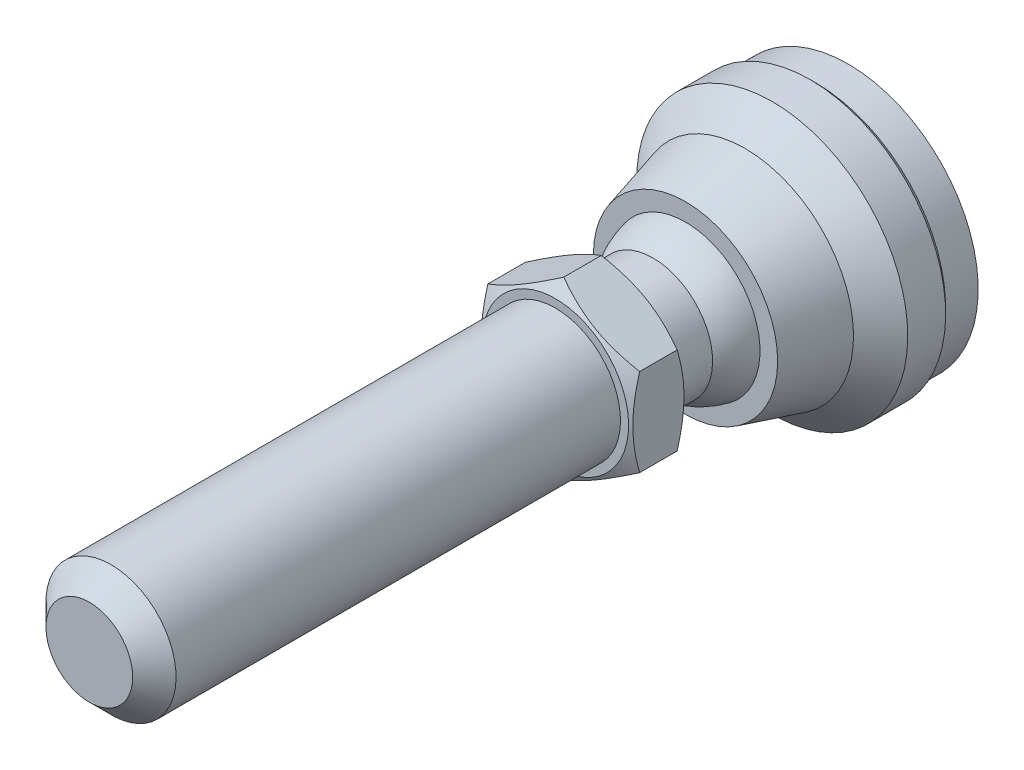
ISO-10303-21;
HEADER;
FILE_DESCRIPTION(('STEP AP214'),'2;1');
FILE_NAME('part.step','',(''),(''),'','','');
FILE_SCHEMA(('AUTOMOTIVE_DESIGN { 1 0 10303 214 1 1 1 1 }'));
ENDSEC;
DATA;
#1=APPLICATION_CONTEXT('core data for automotive mechanical design processes');
#2=APPLICATION_PROTOCOL_DEFINITION('international standard','automotive_design',2000,#1);
#3=PRODUCT_CONTEXT('',#1,'mechanical');
#4=PRODUCT('Part','Part','',(#3));
#5=PRODUCT_RELATED_PRODUCT_CATEGORY('part','',(#4));
#6=PRODUCT_DEFINITION_FORMATION('','',#4);
#7=PRODUCT_DEFINITION_CONTEXT('part definition',#1,'design');
#8=PRODUCT_DEFINITION('design','',#6,#7);
#9=PRODUCT_DEFINITION_SHAPE('','',#8);
#10=(LENGTH_UNIT() NAMED_UNIT(*) SI_UNIT(.MILLI.,.METRE.));
#11=(NAMED_UNIT(*) PLANE_ANGLE_UNIT() SI_UNIT($,.RADIAN.));
#12=(NAMED_UNIT(*) SI_UNIT($,.STERADIAN.) SOLID_ANGLE_UNIT());
#13=UNCERTAINTY_MEASURE_WITH_UNIT(LENGTH_MEASURE(1.E-05),#10,'distance_accuracy_value','');
#14=(GEOMETRIC_REPRESENTATION_CONTEXT(3) GLOBAL_UNCERTAINTY_ASSIGNED_CONTEXT((#13)) GLOBAL_UNIT_ASSIGNED_CONTEXT((#10,
#11,#12)) REPRESENTATION_CONTEXT('',''));
#15=CARTESIAN_POINT('',(0.,0.,0.));
#16=DIRECTION('',(0.,0.,1.));
#17=DIRECTION('',(1.,0.,0.));
#18=AXIS2_PLACEMENT_3D('',#15,#16,#17);
#19=CARTESIAN_POINT('',(-5.49999999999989,0.,21.9999999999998));
#20=DIRECTION('',(0.,0.,1.));
#21=DIRECTION('',(0.,-1.,0.));
#22=AXIS2_PLACEMENT_3D('',#19,#20,#21);
#23=PLANE('',#22);
#24=CARTESIAN_POINT('',(0.,0.,21.9999999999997));
#25=DIRECTION('',(0.,0.,1.));
#26=DIRECTION('',(0.,-1.,0.));
#27=AXIS2_PLACEMENT_3D('',#24,#25,#26);
#28=CIRCLE('',#27,6.75);
#29=CARTESIAN_POINT('',(0.,-6.75,21.9999999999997));
#30=VERTEX_POINT('',#29);
#31=EDGE_CURVE('E440',#30,#30,#28,.T.);
#32=ORIENTED_EDGE('',*,*,#31,.F.);
#33=EDGE_LOOP('',(#32));
#34=FACE_BOUND('',#33,.T.);
#35=CARTESIAN_POINT('',(0.,0.,21.9999999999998));
#36=DIRECTION('',(0.,0.,-1.));
#37=DIRECTION('',(0.,1.,0.));
#38=AXIS2_PLACEMENT_3D('',#35,#36,#37);
#39=CIRCLE('',#38,5.49999999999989);
#40=CARTESIAN_POINT('',(0.,5.49999999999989,21.9999999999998));
#41=VERTEX_POINT('',#40);
#42=EDGE_CURVE('E120',#41,#41,#39,.T.);
#43=ORIENTED_EDGE('',*,*,#42,.F.);
#44=EDGE_LOOP('',(#43));
#45=FACE_BOUND('',#44,.T.);
#46=ADVANCED_FACE('F14',(#34,#45),#23,.F.);
#47=CARTESIAN_POINT('',(0.,0.,0.));
#48=DIRECTION('',(0.,0.,-1.));
#49=DIRECTION('',(0.,1.,0.));
#50=AXIS2_PLACEMENT_3D('',#47,#48,#49);
#51=CYLINDRICAL_SURFACE('',#50,5.49999999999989);
#52=CARTESIAN_POINT('',(0.,0.,18.));
#53=DIRECTION('',(0.,0.,-1.));
#54=DIRECTION('',(0.,1.,0.));
#55=AXIS2_PLACEMENT_3D('',#52,#53,#54);
#56=CIRCLE('',#55,5.49999999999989);
#57=CARTESIAN_POINT('',(-5.49999999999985,0.,18.));
#58=VERTEX_POINT('',#57);
#59=EDGE_CURVE('E117',#58,#58,#56,.T.);
#60=ORIENTED_EDGE('',*,*,#59,.F.);
#61=EDGE_LOOP('',(#60));
#62=FACE_BOUND('',#61,.T.);
#63=ORIENTED_EDGE('',*,*,#42,.T.);
#64=EDGE_LOOP('',(#63));
#65=FACE_BOUND('',#64,.T.);
#66=ADVANCED_FACE('F144',(#62,#65),#51,.T.);
#67=CARTESIAN_POINT('',(0.,0.,13.6698729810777));
#68=DIRECTION('',(0.,0.,-1.));
#69=DIRECTION('',(-1.,0.,0.));
#70=AXIS2_PLACEMENT_3D('',#67,#68,#69);
#71=SPHERICAL_SURFACE('',#70,7.);
#72=CARTESIAN_POINT('',(0.,0.,15.));
#73=DIRECTION('',(0.,0.,-1.));
#74=DIRECTION('',(0.,1.,0.));
#75=AXIS2_PLACEMENT_3D('',#72,#73,#74);
#76=CIRCLE('',#75,6.87246404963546);
#77=CARTESIAN_POINT('',(-6.87246404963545,0.,15.));
#78=VERTEX_POINT('',#77);
#79=EDGE_CURVE('E114',#78,#78,#76,.T.);
#80=CARTESIAN_POINT('',(-6.87246404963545,0.,15.));
#81=CARTESIAN_POINT('',(-6.86587210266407,0.,15.0340591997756));
#82=CARTESIAN_POINT('',(-6.85902692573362,0.,15.0680693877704));
#83=CARTESIAN_POINT('',(-6.84483171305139,0.,15.1359842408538));
#84=CARTESIAN_POINT('',(-6.83748167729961,0.,15.1698889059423));
#85=CARTESIAN_POINT('',(-6.82227834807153,0.,15.2375852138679));
#86=CARTESIAN_POINT('',(-6.81442505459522,0.,15.2713768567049));
#87=CARTESIAN_POINT('',(-6.79821695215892,0.,15.3388396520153));
#88=CARTESIAN_POINT('',(-6.78986214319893,0.,15.3725108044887));
#89=CARTESIAN_POINT('',(-6.77265285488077,0.,15.4397251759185));
#90=CARTESIAN_POINT('',(-6.7637983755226,0.,15.473268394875));
#91=CARTESIAN_POINT('',(-6.74559170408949,0.,15.5402194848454));
#92=CARTESIAN_POINT('',(-6.73623951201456,0.,15.5736273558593));
#93=CARTESIAN_POINT('',(-6.71703948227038,0.,15.6403003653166));
#94=CARTESIAN_POINT('',(-6.70719164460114,0.,15.67356550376));
#95=CARTESIAN_POINT('',(-6.68700250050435,0.,15.7399456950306));
#96=CARTESIAN_POINT('',(-6.67666119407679,0.,15.7730607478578));
#97=CARTESIAN_POINT('',(-6.65548739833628,0.,15.8391334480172));
#98=CARTESIAN_POINT('',(-6.64465490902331,0.,15.8720910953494));
#99=CARTESIAN_POINT('',(-6.62250114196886,0.,15.9378416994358));
#100=CARTESIAN_POINT('',(-6.61117986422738,0.,15.9706346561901));
#101=CARTESIAN_POINT('',(-6.58805102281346,0.,16.0360486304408));
#102=CARTESIAN_POINT('',(-6.57624345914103,0.,16.0686696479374));
#103=CARTESIAN_POINT('',(-6.55214465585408,0.,16.1337325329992));
#104=CARTESIAN_POINT('',(-6.53985341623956,0.,16.1661744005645));
#105=CARTESIAN_POINT('',(-6.51478997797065,0.,16.2308718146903));
#106=CARTESIAN_POINT('',(-6.50201777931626,0.,16.2631273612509));
#107=CARTESIAN_POINT('',(-6.47599524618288,0.,16.3274450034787));
#108=CARTESIAN_POINT('',(-6.4627449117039,0.,16.3595070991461));
#109=CARTESIAN_POINT('',(-6.43576903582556,0.,16.4234307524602));
#110=CARTESIAN_POINT('',(-6.4220434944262,0.,16.455292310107));
#111=CARTESIAN_POINT('',(-6.39412023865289,0.,16.5188078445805));
#112=CARTESIAN_POINT('',(-6.37992252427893,0.,16.5504618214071));
#113=CARTESIAN_POINT('',(-6.35105806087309,0.,16.6135551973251));
#114=CARTESIAN_POINT('',(-6.33639131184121,0.,16.6449945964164));
#115=CARTESIAN_POINT('',(-6.30659202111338,0.,16.7076518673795));
#116=CARTESIAN_POINT('',(-6.29145947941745,0.,16.7388697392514));
#117=CARTESIAN_POINT('',(-6.26073194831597,0.,16.8010770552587));
#118=CARTESIAN_POINT('',(-6.24513695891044,0.,16.8320664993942));
#119=CARTESIAN_POINT('',(-6.21348797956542,0.,16.8938101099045));
#120=CARTESIAN_POINT('',(-6.19743398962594,0.,16.9245642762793));
#121=CARTESIAN_POINT('',(-6.16487055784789,0.,16.9858305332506));
#122=CARTESIAN_POINT('',(-6.14836111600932,0.,17.016342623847));
#123=CARTESIAN_POINT('',(-6.11489042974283,0.,17.0771179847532));
#124=CARTESIAN_POINT('',(-6.0979291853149,0.,17.107381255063));
#125=CARTESIAN_POINT('',(-6.06355864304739,0.,17.1676522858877));
#126=CARTESIAN_POINT('',(-6.04614934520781,0.,17.1976600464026));
#127=CARTESIAN_POINT('',(-6.01088654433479,0.,17.2574134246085));
#128=CARTESIAN_POINT('',(-5.99303304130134,0.,17.2871590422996));
#129=CARTESIAN_POINT('',(-5.95688577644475,0.,17.3463815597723));
#130=CARTESIAN_POINT('',(-5.93859201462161,0.,17.3758584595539));
#131=CARTESIAN_POINT('',(-5.90156827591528,0.,17.4345370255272));
#132=CARTESIAN_POINT('',(-5.88283829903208,0.,17.4637386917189));
#133=CARTESIAN_POINT('',(-5.84494627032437,0.,17.5218603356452));
#134=CARTESIAN_POINT('',(-5.82578421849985,0.,17.5507803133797));
#135=CARTESIAN_POINT('',(-5.78703227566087,0.,17.6083321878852));
#136=CARTESIAN_POINT('',(-5.76744238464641,0.,17.6369640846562));
#137=CARTESIAN_POINT('',(-5.72783909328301,0.,17.6939334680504));
#138=CARTESIAN_POINT('',(-5.70782569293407,0.,17.7222709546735));
#139=CARTESIAN_POINT('',(-5.66737980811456,0.,17.778645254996));
#140=CARTESIAN_POINT('',(-5.646947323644,0.,17.8066820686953));
#141=CARTESIAN_POINT('',(-5.60566778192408,0.,17.862448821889));
#142=CARTESIAN_POINT('',(-5.58482072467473,0.,17.8901787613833));
#143=CARTESIAN_POINT('',(-5.54271666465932,0.,17.9453256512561));
#144=CARTESIAN_POINT('',(-5.52145966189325,0.,17.9727426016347));
#145=CARTESIAN_POINT('',(-5.49999999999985,0.,18.));
#146=B_SPLINE_CURVE_WITH_KNOTS('',3,(#80,#81,#82,#83,#84,#85,#86,#87,#88,#89,#90,#91,#92,#93,
#94,#95,#96,#97,#98,#99,#100,#101,#102,#103,#104,#105,#106,#107,#108,#109,#110,#111,#112,#113,
#114,#115,#116,#117,#118,#119,#120,#121,#122,#123,#124,#125,#126,#127,#128,#129,#130,#131,#132,
#133,#134,#135,#136,#137,#138,#139,#140,#141,#142,#143,#144,#145),.UNSPECIFIED.,.F.,.F.,(4,2,2,
2,2,2,2,2,2,2,2,2,2,2,2,2,2,2,2,2,2,2,2,2,2,2,2,2,2,2,2,2,4),(0.,0.104072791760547,
0.208145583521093,0.312218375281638,0.416291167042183,0.520363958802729,0.624436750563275,
0.728509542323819,0.832582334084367,0.936655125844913,1.04072791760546,1.144800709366,
1.24887350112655,1.3529462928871,1.45701908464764,1.56109187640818,1.66516466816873,
1.76923745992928,1.87331025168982,1.97738304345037,2.08145583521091,2.18552862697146,
2.28960141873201,2.39367421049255,2.4977470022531,2.60181979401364,2.70589258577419,
2.80996537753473,2.91403816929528,3.01811096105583,3.12218375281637,3.22625654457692,
3.33032933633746),.UNSPECIFIED.);
#147=EDGE_CURVE('BSEAM151',#78,#58,#146,.T.);
#148=ORIENTED_EDGE('',*,*,#79,.F.);
#149=ORIENTED_EDGE('',*,*,#59,.T.);
#150=ORIENTED_EDGE('',*,*,#147,.T.);
#151=ORIENTED_EDGE('',*,*,#147,.F.);
#152=EDGE_LOOP('',(#148,#150,#149,#151));
#153=FACE_BOUND('',#152,.T.);
#154=ADVANCED_FACE('F151',(#153),#71,.T.);
#155=CARTESIAN_POINT('',(-8.5,0.,15.));
#156=DIRECTION('',(0.,0.,-1.));
#157=DIRECTION('',(0.,1.,0.));
#158=AXIS2_PLACEMENT_3D('',#155,#156,#157);
#159=PLANE('',#158);
#160=CARTESIAN_POINT('',(0.,0.,15.));
#161=DIRECTION('',(0.,0.,-1.));
#162=DIRECTION('',(0.,1.,0.));
#163=AXIS2_PLACEMENT_3D('',#160,#161,#162);
#164=CIRCLE('',#163,8.5);
#165=CARTESIAN_POINT('',(0.,8.5,15.));
#166=VERTEX_POINT('',#165);
#167=EDGE_CURVE('E111',#166,#166,#164,.T.);
#168=ORIENTED_EDGE('',*,*,#167,.F.);
#169=EDGE_LOOP('',(#168));
#170=FACE_BOUND('',#169,.T.);
#171=ORIENTED_EDGE('',*,*,#79,.T.);
#172=EDGE_LOOP('',(#171));
#173=FACE_BOUND('',#172,.T.);
#174=ADVANCED_FACE('F303',(#170,#173),#159,.F.);
#175=CARTESIAN_POINT('',(0.,0.,15.));
#176=DIRECTION('',(0.,0.,-1.));
#177=DIRECTION('',(0.,1.,0.));
#178=AXIS2_PLACEMENT_3D('',#175,#176,#177);
#179=CONICAL_SURFACE('',#178,8.5,0.266252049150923);
#180=CARTESIAN_POINT('',(0.,0.,9.4999999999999));
#181=DIRECTION('',(0.,0.,-1.));
#182=DIRECTION('',(0.,1.,0.));
#183=AXIS2_PLACEMENT_3D('',#180,#181,#182);
#184=CIRCLE('',#183,10.);
#185=CARTESIAN_POINT('',(0.,10.,9.4999999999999));
#186=VERTEX_POINT('',#185);
#187=EDGE_CURVE('E108',#186,#186,#184,.T.);
#188=ORIENTED_EDGE('',*,*,#187,.F.);
#189=EDGE_LOOP('',(#188));
#190=FACE_BOUND('',#189,.T.);
#191=ORIENTED_EDGE('',*,*,#167,.T.);
#192=EDGE_LOOP('',(#191));
#193=FACE_BOUND('',#192,.T.);
#194=ADVANCED_FACE('F293',(#190,#193),#179,.T.);
#195=CARTESIAN_POINT('',(0.,0.,9.4999999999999));
#196=DIRECTION('',(0.,0.,-1.));
#197=DIRECTION('',(0.,1.,0.));
#198=AXIS2_PLACEMENT_3D('',#195,#196,#197);
#199=CONICAL_SURFACE('',#198,10.,0.785398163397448);
#200=CARTESIAN_POINT('',(0.,0.,6.99999999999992));
#201=DIRECTION('',(0.,0.,-1.));
#202=DIRECTION('',(0.,1.,0.));
#203=AXIS2_PLACEMENT_3D('',#200,#201,#202);
#204=CIRCLE('',#203,12.5);
#205=CARTESIAN_POINT('',(0.,12.5,6.99999999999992));
#206=VERTEX_POINT('',#205);
#207=EDGE_CURVE('E105',#206,#206,#204,.T.);
#208=ORIENTED_EDGE('',*,*,#207,.F.);
#209=EDGE_LOOP('',(#208));
#210=FACE_BOUND('',#209,.T.);
#211=ORIENTED_EDGE('',*,*,#187,.T.);
#212=EDGE_LOOP('',(#211));
#213=FACE_BOUND('',#212,.T.);
#214=ADVANCED_FACE('F283',(#210,#213),#199,.T.);
#215=CARTESIAN_POINT('',(0.,0.,0.));
#216=DIRECTION('',(0.,0.,-1.));
#217=DIRECTION('',(0.,1.,0.));
#218=AXIS2_PLACEMENT_3D('',#215,#216,#217);
#219=CYLINDRICAL_SURFACE('',#218,12.5);
#220=CARTESIAN_POINT('',(0.,0.,3.49999999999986));
#221=DIRECTION('',(0.,0.,-1.));
#222=DIRECTION('',(0.,1.,0.));
#223=AXIS2_PLACEMENT_3D('',#220,#221,#222);
#224=CIRCLE('',#223,12.5);
#225=CARTESIAN_POINT('',(0.,12.5,3.49999999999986));
#226=VERTEX_POINT('',#225);
#227=EDGE_CURVE('E102',#226,#226,#224,.T.);
#228=ORIENTED_EDGE('',*,*,#227,.F.);
#229=EDGE_LOOP('',(#228));
#230=FACE_BOUND('',#229,.T.);
#231=ORIENTED_EDGE('',*,*,#207,.T.);
#232=EDGE_LOOP('',(#231));
#233=FACE_BOUND('',#232,.T.);
#234=ADVANCED_FACE('F273',(#230,#233),#219,.T.);
#235=CARTESIAN_POINT('',(0.,0.,3.49999999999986));
#236=DIRECTION('',(0.,0.,1.));
#237=DIRECTION('',(0.,-1.,0.));
#238=AXIS2_PLACEMENT_3D('',#235,#236,#237);
#239=CONICAL_SURFACE('',#238,12.5,0.785398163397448);
#240=CARTESIAN_POINT('',(0.,0.,2.99999999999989));
#241=DIRECTION('',(0.,0.,-1.));
#242=DIRECTION('',(0.,1.,0.));
#243=AXIS2_PLACEMENT_3D('',#240,#241,#242);
#244=CIRCLE('',#243,12.);
#245=CARTESIAN_POINT('',(0.,12.,2.99999999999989));
#246=VERTEX_POINT('',#245);
#247=EDGE_CURVE('E99',#246,#246,#244,.T.);
#248=ORIENTED_EDGE('',*,*,#247,.F.);
#249=EDGE_LOOP('',(#248));
#250=FACE_BOUND('',#249,.T.);
#251=ORIENTED_EDGE('',*,*,#227,.T.);
#252=EDGE_LOOP('',(#251));
#253=FACE_BOUND('',#252,.T.);
#254=ADVANCED_FACE('F263',(#250,#253),#239,.T.);
#255=CARTESIAN_POINT('',(0.,0.,0.));
#256=DIRECTION('',(0.,0.,-1.));
#257=DIRECTION('',(0.,1.,0.));
#258=AXIS2_PLACEMENT_3D('',#255,#256,#257);
#259=CYLINDRICAL_SURFACE('',#258,12.);
#260=CARTESIAN_POINT('',(0.,0.,0.));
#261=DIRECTION('',(0.,0.,-1.));
#262=DIRECTION('',(0.,1.,0.));
#263=AXIS2_PLACEMENT_3D('',#260,#261,#262);
#264=CIRCLE('',#263,12.);
#265=CARTESIAN_POINT('',(0.,12.,0.));
#266=VERTEX_POINT('',#265);
#267=EDGE_CURVE('E96',#266,#266,#264,.T.);
#268=ORIENTED_EDGE('',*,*,#267,.F.);
#269=EDGE_LOOP('',(#268));
#270=FACE_BOUND('',#269,.T.);
#271=ORIENTED_EDGE('',*,*,#247,.T.);
#272=EDGE_LOOP('',(#271));
#273=FACE_BOUND('',#272,.T.);
#274=ADVANCED_FACE('F252',(#270,#273),#259,.T.);
#275=CARTESIAN_POINT('',(-12.,0.,0.));
#276=DIRECTION('',(0.,0.,1.));
#277=DIRECTION('',(0.,-1.,0.));
#278=AXIS2_PLACEMENT_3D('',#275,#276,#277);
#279=PLANE('',#278);
#280=ORIENTED_EDGE('',*,*,#267,.T.);
#281=EDGE_LOOP('',(#280));
#282=FACE_BOUND('',#281,.T.);
#283=ADVANCED_FACE('F142',(#282),#279,.F.);
#284=CARTESIAN_POINT('',(0.,0.,21.9999999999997));
#285=DIRECTION('',(0.,0.,1.));
#286=DIRECTION('',(0.,-1.,0.));
#287=AXIS2_PLACEMENT_3D('',#284,#285,#286);
#288=CONICAL_SURFACE('',#287,6.75,1.0471975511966);
#289=CARTESIAN_POINT('',(0.000200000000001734,-8.0830192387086,22.7696190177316));
#290=CARTESIAN_POINT('',(-0.153667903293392,-7.99418356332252,22.7183374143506));
#291=CARTESIAN_POINT('',(-0.308109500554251,-7.90501666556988,22.6693831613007));
#292=CARTESIAN_POINT('',(-0.618246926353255,-7.72595873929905,22.5767703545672));
#293=CARTESIAN_POINT('',(-0.773943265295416,-7.63606741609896,22.5331140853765));
#294=CARTESIAN_POINT('',(-1.24352516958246,-7.36495417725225,22.4109491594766));
#295=CARTESIAN_POINT('',(-1.5592643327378,-7.18266208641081,22.3414631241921));
#296=CARTESIAN_POINT('',(-2.03176224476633,-6.90986528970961,22.2599825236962));
#297=CARTESIAN_POINT('',(-2.18710922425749,-6.82017566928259,22.2367710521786));
#298=CARTESIAN_POINT('',(-2.49850511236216,-6.64039116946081,22.1978487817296));
#299=CARTESIAN_POINT('',(-2.65455395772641,-6.55029632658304,22.1821373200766));
#300=CARTESIAN_POINT('',(-2.96692267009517,-6.36995016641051,22.1586154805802));
#301=CARTESIAN_POINT('',(-3.12324202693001,-6.27969914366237,22.15079613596));
#302=CARTESIAN_POINT('',(-3.43601650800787,-6.09911871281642,22.1432178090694));
#303=CARTESIAN_POINT('',(-3.59247162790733,-6.00878930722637,22.1434585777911));
#304=CARTESIAN_POINT('',(-4.02110687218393,-5.76131663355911,22.1551972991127));
#305=CARTESIAN_POINT('',(-4.2931466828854,-5.60425437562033,22.17490331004));
#306=CARTESIAN_POINT('',(-4.8354194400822,-5.29117305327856,22.2373910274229));
#307=CARTESIAN_POINT('',(-5.10565047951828,-5.13515508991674,22.2801940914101));
#308=CARTESIAN_POINT('',(-5.64901454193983,-4.82144370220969,22.3871892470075));
#309=CARTESIAN_POINT('',(-5.92207900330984,-4.6637898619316,22.4518346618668));
#310=CARTESIAN_POINT('',(-6.46413578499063,-4.35083323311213,22.5985536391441));
#311=CARTESIAN_POINT('',(-6.73313504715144,-4.19552643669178,22.6805927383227));
#312=CARTESIAN_POINT('',(-7.0002,-4.04133641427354,22.7696190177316));
#313=B_SPLINE_CURVE_WITH_KNOTS('',3,(#289,#290,#291,#292,#293,#294,#295,#296,#297,#298,#299,
#300,#301,#302,#303,#304,#305,#306,#307,#308,#309,#310,#311,#312),.UNSPECIFIED.,.F.,.F.,(4,2,2,
2,2,2,2,2,2,2,2,4),(0.,0.554727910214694,1.10969417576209,2.2219327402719,2.76443041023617,
3.30688013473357,3.8487128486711,4.39052882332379,5.33376515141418,6.27787517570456,
7.2429241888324,8.20607866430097),.UNSPECIFIED.);
#314=CARTESIAN_POINT('',(0.,-8.08290376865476,22.7695523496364));
#315=VERTEX_POINT('',#314);
#316=CARTESIAN_POINT('',(-7.,-4.04145188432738,22.7695523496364));
#317=VERTEX_POINT('',#316);
#318=EDGE_CURVE('E73',#315,#317,#313,.T.);
#319=ORIENTED_EDGE('',*,*,#318,.T.);
#320=CARTESIAN_POINT('',(-7.,10.8286918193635,25.5473593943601));
#321=CARTESIAN_POINT('',(-7.,10.5231814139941,25.3992688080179));
#322=CARTESIAN_POINT('',(-7.,10.216966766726,25.2526060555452));
#323=CARTESIAN_POINT('',(-7.,9.60275435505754,24.9629398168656));
#324=CARTESIAN_POINT('',(-7.,9.29475631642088,24.8199369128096));
#325=CARTESIAN_POINT('',(-7.,8.67500254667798,24.537668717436));
#326=CARTESIAN_POINT('',(-7.,8.36323546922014,24.3984282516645));
#327=CARTESIAN_POINT('',(-7.,7.73721214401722,24.1256819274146));
#328=CARTESIAN_POINT('',(-7.,7.42295601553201,23.9921757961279));
#329=CARTESIAN_POINT('',(-7.,6.78141808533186,23.7282846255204));
#330=CARTESIAN_POINT('',(-7.,6.45403957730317,23.598133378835));
#331=CARTESIAN_POINT('',(-7.,5.79544324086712,23.3477470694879));
#332=CARTESIAN_POINT('',(-7.,5.46422498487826,23.2275131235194));
#333=CARTESIAN_POINT('',(-7.,4.79804695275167,23.000138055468));
#334=CARTESIAN_POINT('',(-7.,4.46309640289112,22.8929701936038));
#335=CARTESIAN_POINT('',(-7.,3.7884029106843,22.695182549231));
#336=CARTESIAN_POINT('',(-7.,3.44866152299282,22.6045575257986));
#337=CARTESIAN_POINT('',(-7.,2.76601627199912,22.4447088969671));
#338=CARTESIAN_POINT('',(-7.,2.42314007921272,22.3753703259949));
#339=CARTESIAN_POINT('',(-7.,1.90572527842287,22.2903429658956));
#340=CARTESIAN_POINT('',(-7.,1.73272401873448,22.2651627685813));
#341=CARTESIAN_POINT('',(-7.,1.38587085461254,22.2216237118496));
#342=CARTESIAN_POINT('',(-7.,1.21201903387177,22.2032641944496));
#343=CARTESIAN_POINT('',(-7.,0.86595694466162,22.1739611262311));
#344=CARTESIAN_POINT('',(-7.,0.69375457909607,22.1629246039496));
#345=CARTESIAN_POINT('',(-7.,0.349037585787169,22.1481416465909));
#346=CARTESIAN_POINT('',(-7.,0.176522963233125,22.1443950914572));
#347=CARTESIAN_POINT('',(-7.,-0.16851049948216,22.1442813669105));
#348=CARTESIAN_POINT('',(-7.,-0.341029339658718,22.1479142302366));
#349=CARTESIAN_POINT('',(-7.,-0.685761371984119,22.162471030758));
#350=CARTESIAN_POINT('',(-7.,-0.857974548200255,22.1733953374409));
#351=CARTESIAN_POINT('',(-7.,-1.2726802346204,22.208251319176));
#352=CARTESIAN_POINT('',(-7.,-1.51488424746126,22.2356883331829));
#353=CARTESIAN_POINT('',(-7.,-1.99746537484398,22.3034816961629));
#354=CARTESIAN_POINT('',(-7.,-2.23784223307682,22.343839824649));
#355=CARTESIAN_POINT('',(-7.,-2.95597361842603,22.4821533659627));
#356=CARTESIAN_POINT('',(-7.,-3.43045508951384,22.5973218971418));
#357=CARTESIAN_POINT('',(-7.,-4.13989759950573,22.7966681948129));
#358=CARTESIAN_POINT('',(-7.,-4.37854765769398,22.8684692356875));
#359=CARTESIAN_POINT('',(-7.,-4.85352918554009,23.0194376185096));
#360=CARTESIAN_POINT('',(-7.,-5.08986064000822,23.0986050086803));
#361=CARTESIAN_POINT('',(-7.,-5.56028108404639,23.2630434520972));
#362=CARTESIAN_POINT('',(-7.,-5.79437080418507,23.3483124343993));
#363=CARTESIAN_POINT('',(-7.,-6.26061686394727,23.52395988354));
#364=CARTESIAN_POINT('',(-7.,-6.49277322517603,23.6143382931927));
#365=CARTESIAN_POINT('',(-7.,-7.0364287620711,23.8317749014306));
#366=CARTESIAN_POINT('',(-7.,-7.34722443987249,23.9605886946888));
#367=CARTESIAN_POINT('',(-7.,-7.96621020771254,24.2243490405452));
#368=CARTESIAN_POINT('',(-7.,-8.27440014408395,24.3592959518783));
#369=CARTESIAN_POINT('',(-7.,-8.88864820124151,24.6341026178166));
#370=CARTESIAN_POINT('',(-7.,-9.19470589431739,24.7739633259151));
#371=CARTESIAN_POINT('',(-7.,-9.80499359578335,25.0576239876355));
#372=CARTESIAN_POINT('',(-7.,-10.1092235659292,25.2014240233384));
#373=CARTESIAN_POINT('',(-7.,-10.7164622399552,25.4923790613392));
#374=CARTESIAN_POINT('',(-7.,-11.0194693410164,25.6395374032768));
#375=CARTESIAN_POINT('',(-7.,-11.6241859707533,25.9364988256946));
#376=CARTESIAN_POINT('',(-7.,-11.9258954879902,26.0863019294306));
#377=CARTESIAN_POINT('',(-7.,-12.8293073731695,26.5389422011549));
#378=CARTESIAN_POINT('',(-7.,-13.4293717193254,26.8450483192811));
#379=CARTESIAN_POINT('',(-7.,-14.5768048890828,27.4378298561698));
#380=CARTESIAN_POINT('',(-7.,-15.1244265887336,27.7240179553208));
#381=CARTESIAN_POINT('',(-7.,-16.2176321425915,28.3003023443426));
#382=CARTESIAN_POINT('',(-7.,-16.763215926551,28.5903987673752));
#383=CARTESIAN_POINT('',(-7.,-17.8514639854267,29.1728621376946));
#384=CARTESIAN_POINT('',(-7.,-18.3941321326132,29.4652218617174));
#385=CARTESIAN_POINT('',(-7.,-19.478163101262,30.0522829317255));
#386=CARTESIAN_POINT('',(-7.,-20.0195259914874,30.3469841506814));
#387=CARTESIAN_POINT('',(-7.,-20.5604073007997,30.6425606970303));
#388=B_SPLINE_CURVE_WITH_KNOTS('',3,(#320,#321,#322,#323,#324,#325,#326,#327,#328,#329,#330,
#331,#332,#333,#334,#335,#336,#337,#338,#339,#340,#341,#342,#343,#344,#345,#346,#347,#348,#349,
#350,#351,#352,#353,#354,#355,#356,#357,#358,#359,#360,#361,#362,#363,#364,#365,#366,#367,#368,
#369,#370,#371,#372,#373,#374,#375,#376,#377,#378,#379,#380,#381,#382,#383,#384,#385,#386,#387),
.UNSPECIFIED.,.F.,.F.,(4,2,2,2,2,2,2,2,2,2,2,2,2,2,2,2,2,2,2,2,2,2,2,2,2,2,2,2,2,2,2,2,2,4),(0.,
1.01854428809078,2.03724959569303,3.06154681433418,4.08579524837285,5.14257376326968,
6.19947111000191,7.25416785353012,8.30852987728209,9.35709295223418,9.88145204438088,
10.4057605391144,10.9232782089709,11.4407873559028,11.9582987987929,12.4758364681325,
13.2066822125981,13.9376286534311,15.4003431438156,16.1479336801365,16.8955291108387,
17.6428719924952,18.3902065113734,19.3994162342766,20.4086850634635,21.4181508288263,
22.4276376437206,23.4381763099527,24.4487238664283,26.4695569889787,28.3232225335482,
30.1769513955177,32.0261792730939,33.8753075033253),.UNSPECIFIED.);
#389=CARTESIAN_POINT('',(-7.,4.04145188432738,22.7695523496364));
#390=VERTEX_POINT('',#389);
#391=EDGE_CURVE('E81',#317,#390,#388,.F.);
#392=ORIENTED_EDGE('',*,*,#391,.T.);
#393=CARTESIAN_POINT('',(-7.0002,4.04133641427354,22.7696190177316));
#394=CARTESIAN_POINT('',(-6.84633209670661,4.13017208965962,22.7183374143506));
#395=CARTESIAN_POINT('',(-6.69189049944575,4.21933898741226,22.6693831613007));
#396=CARTESIAN_POINT('',(-6.38175307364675,4.39839691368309,22.5767703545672));
#397=CARTESIAN_POINT('',(-6.22605673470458,4.48828823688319,22.5331140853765));
#398=CARTESIAN_POINT('',(-5.75647483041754,4.75940147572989,22.4109491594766));
#399=CARTESIAN_POINT('',(-5.4407356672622,4.94169356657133,22.3414631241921));
#400=CARTESIAN_POINT('',(-4.96823775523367,5.21449036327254,22.2599825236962));
#401=CARTESIAN_POINT('',(-4.81289077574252,5.30417998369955,22.2367710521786));
#402=CARTESIAN_POINT('',(-4.50149488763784,5.48396448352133,22.1978487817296));
#403=CARTESIAN_POINT('',(-4.34544604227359,5.57405932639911,22.1821373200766));
#404=CARTESIAN_POINT('',(-4.03307732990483,5.75440548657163,22.1586154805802));
#405=CARTESIAN_POINT('',(-3.87675797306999,5.84465650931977,22.15079613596));
#406=CARTESIAN_POINT('',(-3.56398349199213,6.02523694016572,22.1432178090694));
#407=CARTESIAN_POINT('',(-3.40752837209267,6.11556634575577,22.1434585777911));
#408=CARTESIAN_POINT('',(-2.97889312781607,6.36303901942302,22.1551972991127));
#409=CARTESIAN_POINT('',(-2.7068533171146,6.52010127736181,22.17490331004));
#410=CARTESIAN_POINT('',(-2.16458055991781,6.83318259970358,22.2373910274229));
#411=CARTESIAN_POINT('',(-1.89434952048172,6.9892005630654,22.2801940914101));
#412=CARTESIAN_POINT('',(-1.35098545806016,7.30291195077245,22.3871892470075));
#413=CARTESIAN_POINT('',(-1.07792099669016,7.46056579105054,22.4518346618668));
#414=CARTESIAN_POINT('',(-0.535864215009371,7.77352241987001,22.5985536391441));
#415=CARTESIAN_POINT('',(-0.26686495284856,7.92882921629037,22.6805927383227));
#416=CARTESIAN_POINT('',(0.0002000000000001,8.0830192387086,22.7696190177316));
#417=B_SPLINE_CURVE_WITH_KNOTS('',3,(#393,#394,#395,#396,#397,#398,#399,#400,#401,#402,#403,
#404,#405,#406,#407,#408,#409,#410,#411,#412,#413,#414,#415,#416),.UNSPECIFIED.,.F.,.F.,(4,2,2,
2,2,2,2,2,2,2,2,4),(0.,0.554727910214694,1.10969417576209,2.2219327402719,2.76443041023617,
3.30688013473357,3.84871284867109,4.39052882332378,5.33376515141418,6.27787517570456,
7.2429241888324,8.20607866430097),.UNSPECIFIED.);
#418=CARTESIAN_POINT('',(0.,8.08290376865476,22.7695523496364));
#419=VERTEX_POINT('',#418);
#420=EDGE_CURVE('E395',#390,#419,#417,.T.);
#421=ORIENTED_EDGE('',*,*,#420,.T.);
#422=CARTESIAN_POINT('',(-0.000199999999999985,8.08301923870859,22.7696190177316));
#423=CARTESIAN_POINT('',(0.153667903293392,7.99418356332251,22.7183374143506));
#424=CARTESIAN_POINT('',(0.30810950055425,7.90501666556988,22.6693831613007));
#425=CARTESIAN_POINT('',(0.618246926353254,7.72595873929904,22.5767703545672));
#426=CARTESIAN_POINT('',(0.773943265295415,7.63606741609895,22.5331140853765));
#427=CARTESIAN_POINT('',(1.24352516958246,7.36495417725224,22.4109491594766));
#428=CARTESIAN_POINT('',(1.5592643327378,7.1826620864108,22.3414631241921));
#429=CARTESIAN_POINT('',(2.03176224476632,6.9098652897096,22.2599825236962));
#430=CARTESIAN_POINT('',(2.18710922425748,6.82017566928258,22.2367710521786));
#431=CARTESIAN_POINT('',(2.49850511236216,6.64039116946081,22.1978487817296));
#432=CARTESIAN_POINT('',(2.6545539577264,6.55029632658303,22.1821373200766));
#433=CARTESIAN_POINT('',(2.96692267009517,6.36995016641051,22.1586154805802));
#434=CARTESIAN_POINT('',(3.12324202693,6.27969914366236,22.15079613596));
#435=CARTESIAN_POINT('',(3.43601650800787,6.09911871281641,22.1432178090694));
#436=CARTESIAN_POINT('',(3.59247162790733,6.00878930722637,22.1434585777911));
#437=CARTESIAN_POINT('',(4.02110687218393,5.76131663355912,22.1551972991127));
#438=CARTESIAN_POINT('',(4.29314668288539,5.60425437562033,22.17490331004));
#439=CARTESIAN_POINT('',(4.83541944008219,5.29117305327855,22.2373910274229));
#440=CARTESIAN_POINT('',(5.10565047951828,5.13515508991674,22.2801940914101));
#441=CARTESIAN_POINT('',(5.64901454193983,4.82144370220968,22.3871892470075));
#442=CARTESIAN_POINT('',(5.92207900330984,4.66378986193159,22.4518346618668));
#443=CARTESIAN_POINT('',(6.46413578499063,4.35083323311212,22.5985536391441));
#444=CARTESIAN_POINT('',(6.73313504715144,4.19552643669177,22.6805927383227));
#445=CARTESIAN_POINT('',(7.0002,4.04133641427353,22.7696190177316));
#446=B_SPLINE_CURVE_WITH_KNOTS('',3,(#422,#423,#424,#425,#426,#427,#428,#429,#430,#431,#432,
#433,#434,#435,#436,#437,#438,#439,#440,#441,#442,#443,#444,#445),.UNSPECIFIED.,.F.,.F.,(4,2,2,
2,2,2,2,2,2,2,2,4),(0.,0.554727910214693,1.10969417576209,2.22193274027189,2.76443041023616,
3.30688013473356,3.84871284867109,4.39052882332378,5.33376515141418,6.27787517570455,
7.24292418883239,8.20607866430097),.UNSPECIFIED.);
#447=CARTESIAN_POINT('',(7.,4.04145188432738,22.7695523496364));
#448=VERTEX_POINT('',#447);
#449=EDGE_CURVE('E390',#419,#448,#446,.T.);
#450=ORIENTED_EDGE('',*,*,#449,.T.);
#451=CARTESIAN_POINT('',(7.,10.8286918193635,25.5473593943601));
#452=CARTESIAN_POINT('',(7.,10.5231814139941,25.3992688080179));
#453=CARTESIAN_POINT('',(7.,10.216966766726,25.2526060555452));
#454=CARTESIAN_POINT('',(7.,9.60275435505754,24.9629398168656));
#455=CARTESIAN_POINT('',(7.,9.29475631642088,24.8199369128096));
#456=CARTESIAN_POINT('',(7.,8.67500254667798,24.537668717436));
#457=CARTESIAN_POINT('',(7.,8.36323546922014,24.3984282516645));
#458=CARTESIAN_POINT('',(7.,7.73721214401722,24.1256819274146));
#459=CARTESIAN_POINT('',(7.,7.42295601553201,23.9921757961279));
#460=CARTESIAN_POINT('',(7.,6.78141808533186,23.7282846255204));
#461=CARTESIAN_POINT('',(7.,6.45403957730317,23.598133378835));
#462=CARTESIAN_POINT('',(7.,5.79544324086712,23.3477470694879));
#463=CARTESIAN_POINT('',(7.,5.46422498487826,23.2275131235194));
#464=CARTESIAN_POINT('',(7.,4.79804695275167,23.000138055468));
#465=CARTESIAN_POINT('',(7.,4.46309640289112,22.8929701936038));
#466=CARTESIAN_POINT('',(7.,3.7884029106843,22.695182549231));
#467=CARTESIAN_POINT('',(7.,3.44866152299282,22.6045575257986));
#468=CARTESIAN_POINT('',(7.,2.76601627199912,22.4447088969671));
#469=CARTESIAN_POINT('',(7.,2.42314007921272,22.3753703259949));
#470=CARTESIAN_POINT('',(7.,1.90572527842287,22.2903429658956));
#471=CARTESIAN_POINT('',(7.,1.73272401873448,22.2651627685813));
#472=CARTESIAN_POINT('',(7.,1.38587085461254,22.2216237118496));
#473=CARTESIAN_POINT('',(7.,1.21201903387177,22.2032641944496));
#474=CARTESIAN_POINT('',(7.,0.86595694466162,22.1739611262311));
#475=CARTESIAN_POINT('',(7.,0.69375457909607,22.1629246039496));
#476=CARTESIAN_POINT('',(7.,0.349037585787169,22.1481416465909));
#477=CARTESIAN_POINT('',(7.,0.176522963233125,22.1443950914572));
#478=CARTESIAN_POINT('',(7.,-0.16851049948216,22.1442813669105));
#479=CARTESIAN_POINT('',(7.,-0.341029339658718,22.1479142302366));
#480=CARTESIAN_POINT('',(7.,-0.685761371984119,22.162471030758));
#481=CARTESIAN_POINT('',(7.,-0.857974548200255,22.1733953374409));
#482=CARTESIAN_POINT('',(7.,-1.2726802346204,22.208251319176));
#483=CARTESIAN_POINT('',(7.,-1.51488424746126,22.2356883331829));
#484=CARTESIAN_POINT('',(7.,-1.99746537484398,22.3034816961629));
#485=CARTESIAN_POINT('',(7.,-2.23784223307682,22.343839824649));
#486=CARTESIAN_POINT('',(7.,-2.95597361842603,22.4821533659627));
#487=CARTESIAN_POINT('',(7.,-3.43045508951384,22.5973218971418));
#488=CARTESIAN_POINT('',(7.,-4.13989759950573,22.7966681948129));
#489=CARTESIAN_POINT('',(7.,-4.37854765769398,22.8684692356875));
#490=CARTESIAN_POINT('',(7.,-4.85352918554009,23.0194376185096));
#491=CARTESIAN_POINT('',(7.,-5.08986064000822,23.0986050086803));
#492=CARTESIAN_POINT('',(7.,-5.56028108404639,23.2630434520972));
#493=CARTESIAN_POINT('',(7.,-5.79437080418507,23.3483124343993));
#494=CARTESIAN_POINT('',(7.,-6.26061686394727,23.52395988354));
#495=CARTESIAN_POINT('',(7.,-6.49277322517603,23.6143382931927));
#496=CARTESIAN_POINT('',(7.,-7.0364287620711,23.8317749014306));
#497=CARTESIAN_POINT('',(7.,-7.34722443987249,23.9605886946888));
#498=CARTESIAN_POINT('',(7.,-7.96621020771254,24.2243490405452));
#499=CARTESIAN_POINT('',(7.,-8.27440014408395,24.3592959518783));
#500=CARTESIAN_POINT('',(7.,-8.88864820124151,24.6341026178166));
#501=CARTESIAN_POINT('',(7.,-9.19470589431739,24.7739633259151));
#502=CARTESIAN_POINT('',(7.,-9.80499359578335,25.0576239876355));
#503=CARTESIAN_POINT('',(7.,-10.1092235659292,25.2014240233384));
#504=CARTESIAN_POINT('',(7.,-10.7164622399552,25.4923790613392));
#505=CARTESIAN_POINT('',(7.,-11.0194693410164,25.6395374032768));
#506=CARTESIAN_POINT('',(7.,-11.6241859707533,25.9364988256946));
#507=CARTESIAN_POINT('',(7.,-11.9258954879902,26.0863019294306));
#508=CARTESIAN_POINT('',(7.,-12.8293073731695,26.5389422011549));
#509=CARTESIAN_POINT('',(7.,-13.4293717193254,26.8450483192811));
#510=CARTESIAN_POINT('',(7.,-14.5768048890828,27.4378298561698));
#511=CARTESIAN_POINT('',(7.,-15.1244265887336,27.7240179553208));
#512=CARTESIAN_POINT('',(7.,-16.2176321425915,28.3003023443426));
#513=CARTESIAN_POINT('',(7.,-16.763215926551,28.5903987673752));
#514=CARTESIAN_POINT('',(7.,-17.8514639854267,29.1728621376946));
#515=CARTESIAN_POINT('',(7.,-18.3941321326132,29.4652218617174));
#516=CARTESIAN_POINT('',(7.,-19.478163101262,30.0522829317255));
#517=CARTESIAN_POINT('',(7.,-20.0195259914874,30.3469841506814));
#518=CARTESIAN_POINT('',(7.,-20.5604073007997,30.6425606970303));
#519=B_SPLINE_CURVE_WITH_KNOTS('',3,(#451,#452,#453,#454,#455,#456,#457,#458,#459,#460,#461,
#462,#463,#464,#465,#466,#467,#468,#469,#470,#471,#472,#473,#474,#475,#476,#477,#478,#479,#480,
#481,#482,#483,#484,#485,#486,#487,#488,#489,#490,#491,#492,#493,#494,#495,#496,#497,#498,#499,
#500,#501,#502,#503,#504,#505,#506,#507,#508,#509,#510,#511,#512,#513,#514,#515,#516,#517,#518),
.UNSPECIFIED.,.F.,.F.,(4,2,2,2,2,2,2,2,2,2,2,2,2,2,2,2,2,2,2,2,2,2,2,2,2,2,2,2,2,2,2,2,2,4),(0.,
1.01854428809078,2.03724959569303,3.06154681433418,4.08579524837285,5.14257376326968,
6.19947111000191,7.25416785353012,8.30852987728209,9.35709295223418,9.88145204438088,
10.4057605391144,10.9232782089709,11.4407873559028,11.9582987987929,12.4758364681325,
13.2066822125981,13.9376286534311,15.4003431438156,16.1479336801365,16.8955291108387,
17.6428719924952,18.3902065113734,19.3994162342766,20.4086850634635,21.4181508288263,
22.4276376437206,23.4381763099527,24.4487238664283,26.4695569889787,28.3232225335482,
30.1769513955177,32.0261792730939,33.8753075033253),.UNSPECIFIED.);
#520=CARTESIAN_POINT('',(7.,-4.04145188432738,22.7695523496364));
#521=VERTEX_POINT('',#520);
#522=EDGE_CURVE('E34',#448,#521,#519,.T.);
#523=ORIENTED_EDGE('',*,*,#522,.T.);
#524=CARTESIAN_POINT('',(7.0002,-4.04133641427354,22.7696190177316));
#525=CARTESIAN_POINT('',(6.84633209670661,-4.13017208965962,22.7183374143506));
#526=CARTESIAN_POINT('',(6.69189049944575,-4.21933898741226,22.6693831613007));
#527=CARTESIAN_POINT('',(6.38175307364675,-4.39839691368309,22.5767703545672));
#528=CARTESIAN_POINT('',(6.22605673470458,-4.48828823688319,22.5331140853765));
#529=CARTESIAN_POINT('',(5.75647483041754,-4.75940147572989,22.4109491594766));
#530=CARTESIAN_POINT('',(5.4407356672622,-4.94169356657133,22.3414631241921));
#531=CARTESIAN_POINT('',(4.96823775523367,-5.21449036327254,22.2599825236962));
#532=CARTESIAN_POINT('',(4.81289077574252,-5.30417998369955,22.2367710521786));
#533=CARTESIAN_POINT('',(4.50149488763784,-5.48396448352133,22.1978487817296));
#534=CARTESIAN_POINT('',(4.34544604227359,-5.57405932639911,22.1821373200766));
#535=CARTESIAN_POINT('',(4.03307732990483,-5.75440548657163,22.1586154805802));
#536=CARTESIAN_POINT('',(3.87675797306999,-5.84465650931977,22.15079613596));
#537=CARTESIAN_POINT('',(3.56398349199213,-6.02523694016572,22.1432178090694));
#538=CARTESIAN_POINT('',(3.40752837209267,-6.11556634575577,22.1434585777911));
#539=CARTESIAN_POINT('',(2.97889312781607,-6.36303901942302,22.1551972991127));
#540=CARTESIAN_POINT('',(2.7068533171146,-6.52010127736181,22.17490331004));
#541=CARTESIAN_POINT('',(2.16458055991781,-6.83318259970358,22.2373910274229));
#542=CARTESIAN_POINT('',(1.89434952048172,-6.9892005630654,22.2801940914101));
#543=CARTESIAN_POINT('',(1.35098545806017,-7.30291195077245,22.3871892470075));
#544=CARTESIAN_POINT('',(1.07792099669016,-7.46056579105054,22.4518346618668));
#545=CARTESIAN_POINT('',(0.535864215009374,-7.77352241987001,22.5985536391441));
#546=CARTESIAN_POINT('',(0.266864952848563,-7.92882921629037,22.6805927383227));
#547=CARTESIAN_POINT('',(-0.0001999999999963,-8.0830192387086,22.7696190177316));
#548=B_SPLINE_CURVE_WITH_KNOTS('',3,(#524,#525,#526,#527,#528,#529,#530,#531,#532,#533,#534,
#535,#536,#537,#538,#539,#540,#541,#542,#543,#544,#545,#546,#547),.UNSPECIFIED.,.F.,.F.,(4,2,2,
2,2,2,2,2,2,2,2,4),(0.,0.554727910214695,1.10969417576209,2.2219327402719,2.76443041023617,
3.30688013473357,3.84871284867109,4.39052882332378,5.33376515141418,6.27787517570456,
7.2429241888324,8.20607866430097),.UNSPECIFIED.);
#549=EDGE_CURVE('E9',#521,#315,#548,.T.);
#550=ORIENTED_EDGE('',*,*,#549,.T.);
#551=EDGE_LOOP('',(#319,#392,#421,#450,#523,#550));
#552=FACE_BOUND('',#551,.T.);
#553=ORIENTED_EDGE('',*,*,#31,.T.);
#554=EDGE_LOOP('',(#553));
#555=FACE_BOUND('',#554,.T.);
#556=ADVANCED_FACE('F71',(#552,#555),#288,.T.);
#557=CARTESIAN_POINT('',(-3.99999999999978,0.,70.));
#558=DIRECTION('',(0.,0.,-1.));
#559=DIRECTION('',(0.,1.,0.));
#560=AXIS2_PLACEMENT_3D('',#557,#558,#559);
#561=PLANE('',#560);
#562=CARTESIAN_POINT('',(0.,0.,70.));
#563=DIRECTION('',(0.,0.,-1.));
#564=DIRECTION('',(0.,1.,0.));
#565=AXIS2_PLACEMENT_3D('',#562,#563,#564);
#566=CIRCLE('',#565,3.99999999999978);
#567=CARTESIAN_POINT('',(0.,3.99999999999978,70.));
#568=VERTEX_POINT('',#567);
#569=EDGE_CURVE('E28',#568,#568,#566,.T.);
#570=ORIENTED_EDGE('',*,*,#569,.F.);
#571=EDGE_LOOP('',(#570));
#572=FACE_BOUND('',#571,.T.);
#573=ADVANCED_FACE('F16',(#572),#561,.F.);
#574=CARTESIAN_POINT('',(0.,0.,70.));
#575=DIRECTION('',(0.,0.,-1.));
#576=DIRECTION('',(0.,1.,0.));
#577=AXIS2_PLACEMENT_3D('',#574,#575,#576);
#578=CONICAL_SURFACE('',#577,3.99999999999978,0.785398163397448);
#579=CARTESIAN_POINT('',(0.,0.,68.));
#580=DIRECTION('',(0.,0.,-1.));
#581=DIRECTION('',(0.,1.,0.));
#582=AXIS2_PLACEMENT_3D('',#579,#580,#581);
#583=CIRCLE('',#582,5.99999999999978);
#584=CARTESIAN_POINT('',(0.,5.99999999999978,68.));
#585=VERTEX_POINT('',#584);
#586=EDGE_CURVE('E126',#585,#585,#583,.T.);
#587=ORIENTED_EDGE('',*,*,#586,.F.);
#588=EDGE_LOOP('',(#587));
#589=FACE_BOUND('',#588,.T.);
#590=ORIENTED_EDGE('',*,*,#569,.T.);
#591=EDGE_LOOP('',(#590));
#592=FACE_BOUND('',#591,.T.);
#593=ADVANCED_FACE('F131',(#589,#592),#578,.T.);
#594=CARTESIAN_POINT('',(0.,0.,0.));
#595=DIRECTION('',(0.,0.,-1.));
#596=DIRECTION('',(0.,1.,0.));
#597=AXIS2_PLACEMENT_3D('',#594,#595,#596);
#598=CYLINDRICAL_SURFACE('',#597,5.99999999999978);
#599=CARTESIAN_POINT('',(0.,0.,27.));
#600=DIRECTION('',(0.,0.,-1.));
#601=DIRECTION('',(0.,1.,0.));
#602=AXIS2_PLACEMENT_3D('',#599,#600,#601);
#603=CIRCLE('',#602,5.99999999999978);
#604=CARTESIAN_POINT('',(0.,5.99999999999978,27.));
#605=VERTEX_POINT('',#604);
#606=EDGE_CURVE('E123',#605,#605,#603,.T.);
#607=ORIENTED_EDGE('',*,*,#606,.F.);
#608=EDGE_LOOP('',(#607));
#609=FACE_BOUND('',#608,.T.);
#610=ORIENTED_EDGE('',*,*,#586,.T.);
#611=EDGE_LOOP('',(#610));
#612=FACE_BOUND('',#611,.T.);
#613=ADVANCED_FACE('F140',(#609,#612),#598,.T.);
#614=CARTESIAN_POINT('',(-5.99999999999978,0.,27.));
#615=DIRECTION('',(0.,0.,-1.));
#616=DIRECTION('',(0.,1.,0.));
#617=AXIS2_PLACEMENT_3D('',#614,#615,#616);
#618=PLANE('',#617);
#619=CARTESIAN_POINT('',(0.,0.,27.));
#620=DIRECTION('',(0.,0.,1.));
#621=DIRECTION('',(0.,-1.,0.));
#622=AXIS2_PLACEMENT_3D('',#619,#620,#621);
#623=CIRCLE('',#622,6.75);
#624=CARTESIAN_POINT('',(0.,-6.75,27.));
#625=VERTEX_POINT('',#624);
#626=EDGE_CURVE('E80',#625,#625,#623,.T.);
#627=ORIENTED_EDGE('',*,*,#626,.T.);
#628=EDGE_LOOP('',(#627));
#629=FACE_BOUND('',#628,.T.);
#630=ORIENTED_EDGE('',*,*,#606,.T.);
#631=EDGE_LOOP('',(#630));
#632=FACE_BOUND('',#631,.T.);
#633=ADVANCED_FACE('F158',(#629,#632),#618,.F.);
#634=CARTESIAN_POINT('',(0.,0.,25.2946586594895));
#635=DIRECTION('',(0.,0.,-1.));
#636=DIRECTION('',(0.,1.,0.));
#637=AXIS2_PLACEMENT_3D('',#634,#635,#636);
#638=CONICAL_SURFACE('',#637,9.70373784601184,1.0471975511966);
#639=CARTESIAN_POINT('',(-7.0002,-4.04133641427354,26.2303809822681));
#640=CARTESIAN_POINT('',(-6.84633209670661,-4.13017208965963,26.2816625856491));
#641=CARTESIAN_POINT('',(-6.69189049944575,-4.21933898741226,26.330616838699));
#642=CARTESIAN_POINT('',(-6.38175307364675,-4.39839691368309,26.4232296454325));
#643=CARTESIAN_POINT('',(-6.22605673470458,-4.48828823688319,26.4668859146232));
#644=CARTESIAN_POINT('',(-5.75647483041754,-4.7594014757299,26.5890508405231));
#645=CARTESIAN_POINT('',(-5.4407356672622,-4.94169356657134,26.6585368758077));
#646=CARTESIAN_POINT('',(-4.96823775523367,-5.21449036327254,26.7400174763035));
#647=CARTESIAN_POINT('',(-4.81289077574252,-5.30417998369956,26.7632289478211));
#648=CARTESIAN_POINT('',(-4.50149488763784,-5.48396448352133,26.8021512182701));
#649=CARTESIAN_POINT('',(-4.34544604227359,-5.57405932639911,26.8178626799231));
#650=CARTESIAN_POINT('',(-4.03307732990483,-5.75440548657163,26.8413845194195));
#651=CARTESIAN_POINT('',(-3.87675797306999,-5.84465650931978,26.8492038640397));
#652=CARTESIAN_POINT('',(-3.56398349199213,-6.02523694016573,26.8567821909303));
#653=CARTESIAN_POINT('',(-3.40752837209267,-6.11556634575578,26.8565414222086));
#654=CARTESIAN_POINT('',(-2.97889312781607,-6.36303901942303,26.844802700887));
#655=CARTESIAN_POINT('',(-2.7068533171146,-6.52010127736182,26.8250966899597));
#656=CARTESIAN_POINT('',(-2.1645805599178,-6.83318259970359,26.7626089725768));
#657=CARTESIAN_POINT('',(-1.89434952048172,-6.98920056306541,26.7198059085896));
#658=CARTESIAN_POINT('',(-1.35098545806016,-7.30291195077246,26.6128107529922));
#659=CARTESIAN_POINT('',(-1.07792099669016,-7.46056579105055,26.5481653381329));
#660=CARTESIAN_POINT('',(-0.53586421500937,-7.77352241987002,26.4014463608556));
#661=CARTESIAN_POINT('',(-0.26686495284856,-7.92882921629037,26.319407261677));
#662=CARTESIAN_POINT('',(0.000200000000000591,-8.0830192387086,26.2303809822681));
#663=B_SPLINE_CURVE_WITH_KNOTS('',3,(#639,#640,#641,#642,#643,#644,#645,#646,#647,#648,#649,
#650,#651,#652,#653,#654,#655,#656,#657,#658,#659,#660,#661,#662),.UNSPECIFIED.,.F.,.F.,(4,2,2,
2,2,2,2,2,2,2,2,4),(0.,0.554727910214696,1.10969417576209,2.2219327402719,2.76443041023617,
3.30688013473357,3.8487128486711,4.39052882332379,5.33376515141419,6.27787517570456,
7.2429241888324,8.20607866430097),.UNSPECIFIED.);
#664=CARTESIAN_POINT('',(-7.,-4.04145188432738,26.2304476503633));
#665=VERTEX_POINT('',#664);
#666=CARTESIAN_POINT('',(0.,-8.08290376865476,26.2304476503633));
#667=VERTEX_POINT('',#666);
#668=EDGE_CURVE('E88',#665,#667,#663,.T.);
#669=ORIENTED_EDGE('',*,*,#668,.T.);
#670=CARTESIAN_POINT('',(-0.000199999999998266,-8.0830192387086,26.2303809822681));
#671=CARTESIAN_POINT('',(0.153667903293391,-7.99418356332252,26.2816625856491));
#672=CARTESIAN_POINT('',(0.308109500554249,-7.90501666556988,26.330616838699));
#673=CARTESIAN_POINT('',(0.618246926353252,-7.72595873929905,26.4232296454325));
#674=CARTESIAN_POINT('',(0.773943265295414,-7.63606741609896,26.4668859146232));
#675=CARTESIAN_POINT('',(1.24352516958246,-7.36495417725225,26.5890508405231));
#676=CARTESIAN_POINT('',(1.5592643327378,-7.18266208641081,26.6585368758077));
#677=CARTESIAN_POINT('',(2.03176224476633,-6.9098652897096,26.7400174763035));
#678=CARTESIAN_POINT('',(2.18710922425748,-6.82017566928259,26.7632289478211));
#679=CARTESIAN_POINT('',(2.49850511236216,-6.64039116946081,26.8021512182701));
#680=CARTESIAN_POINT('',(2.6545539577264,-6.55029632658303,26.8178626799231));
#681=CARTESIAN_POINT('',(2.96692267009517,-6.36995016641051,26.8413845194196));
#682=CARTESIAN_POINT('',(3.12324202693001,-6.27969914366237,26.8492038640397));
#683=CARTESIAN_POINT('',(3.43601650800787,-6.09911871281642,26.8567821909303));
#684=CARTESIAN_POINT('',(3.59247162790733,-6.00878930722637,26.8565414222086));
#685=CARTESIAN_POINT('',(4.02110687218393,-5.76131663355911,26.844802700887));
#686=CARTESIAN_POINT('',(4.2931466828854,-5.60425437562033,26.8250966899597));
#687=CARTESIAN_POINT('',(4.8354194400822,-5.29117305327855,26.7626089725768));
#688=CARTESIAN_POINT('',(5.10565047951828,-5.13515508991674,26.7198059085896));
#689=CARTESIAN_POINT('',(5.64901454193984,-4.82144370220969,26.6128107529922));
#690=CARTESIAN_POINT('',(5.92207900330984,-4.66378986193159,26.5481653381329));
#691=CARTESIAN_POINT('',(6.46413578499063,-4.35083323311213,26.4014463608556));
#692=CARTESIAN_POINT('',(6.73313504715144,-4.19552643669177,26.319407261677));
#693=CARTESIAN_POINT('',(7.0002,-4.04133641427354,26.2303809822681));
#694=B_SPLINE_CURVE_WITH_KNOTS('',3,(#670,#671,#672,#673,#674,#675,#676,#677,#678,#679,#680,
#681,#682,#683,#684,#685,#686,#687,#688,#689,#690,#691,#692,#693),.UNSPECIFIED.,.F.,.F.,(4,2,2,
2,2,2,2,2,2,2,2,4),(0.,0.554727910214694,1.10969417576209,2.2219327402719,2.76443041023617,
3.30688013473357,3.8487128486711,4.39052882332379,5.33376515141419,6.27787517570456,
7.2429241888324,8.20607866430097),.UNSPECIFIED.);
#695=CARTESIAN_POINT('',(7.,-4.04145188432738,26.2304476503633));
#696=VERTEX_POINT('',#695);
#697=EDGE_CURVE('E86',#667,#696,#694,.T.);
#698=ORIENTED_EDGE('',*,*,#697,.T.);
#699=CARTESIAN_POINT('',(7.,10.8286918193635,23.4526406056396));
#700=CARTESIAN_POINT('',(7.,10.5231814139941,23.6007311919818));
#701=CARTESIAN_POINT('',(7.,10.216966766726,23.7473939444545));
#702=CARTESIAN_POINT('',(7.,9.60275435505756,24.0370601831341));
#703=CARTESIAN_POINT('',(7.,9.2947563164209,24.1800630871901));
#704=CARTESIAN_POINT('',(7.,8.67500254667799,24.4623312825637));
#705=CARTESIAN_POINT('',(7.,8.36323546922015,24.6015717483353));
#706=CARTESIAN_POINT('',(7.,7.73721214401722,24.8743180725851));
#707=CARTESIAN_POINT('',(7.,7.42295601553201,25.0078242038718));
#708=CARTESIAN_POINT('',(7.,6.78141808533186,25.2717153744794));
#709=CARTESIAN_POINT('',(7.,6.45403957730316,25.4018666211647));
#710=CARTESIAN_POINT('',(7.,5.79544324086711,25.6522529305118));
#711=CARTESIAN_POINT('',(7.,5.46422498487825,25.7724868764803));
#712=CARTESIAN_POINT('',(7.,4.79804695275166,25.9998619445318));
#713=CARTESIAN_POINT('',(7.,4.4630964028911,26.1070298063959));
#714=CARTESIAN_POINT('',(7.,3.78840291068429,26.3048174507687));
#715=CARTESIAN_POINT('',(7.,3.44866152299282,26.3954424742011));
#716=CARTESIAN_POINT('',(7.,2.76601627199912,26.5552911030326));
#717=CARTESIAN_POINT('',(7.,2.42314007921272,26.6246296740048));
#718=CARTESIAN_POINT('',(7.,1.90572527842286,26.7096570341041));
#719=CARTESIAN_POINT('',(7.,1.73272401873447,26.7348372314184));
#720=CARTESIAN_POINT('',(7.,1.38587085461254,26.7783762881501));
#721=CARTESIAN_POINT('',(7.,1.21201903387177,26.7967358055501));
#722=CARTESIAN_POINT('',(7.,0.865956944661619,26.8260388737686));
#723=CARTESIAN_POINT('',(7.,0.69375457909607,26.8370753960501));
#724=CARTESIAN_POINT('',(7.,0.34903758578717,26.8518583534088));
#725=CARTESIAN_POINT('',(7.,0.176522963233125,26.8556049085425));
#726=CARTESIAN_POINT('',(7.,-0.168510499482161,26.8557186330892));
#727=CARTESIAN_POINT('',(7.,-0.341029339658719,26.8520857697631));
#728=CARTESIAN_POINT('',(7.,-0.685761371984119,26.8375289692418));
#729=CARTESIAN_POINT('',(7.,-0.857974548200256,26.8266046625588));
#730=CARTESIAN_POINT('',(7.,-1.2726802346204,26.7917486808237));
#731=CARTESIAN_POINT('',(7.,-1.51488424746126,26.7643116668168));
#732=CARTESIAN_POINT('',(7.,-1.99746537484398,26.6965183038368));
#733=CARTESIAN_POINT('',(7.,-2.23784223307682,26.6561601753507));
#734=CARTESIAN_POINT('',(7.,-2.95597361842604,26.517846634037));
#735=CARTESIAN_POINT('',(7.,-3.43045508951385,26.402678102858));
#736=CARTESIAN_POINT('',(7.,-4.13989759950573,26.2033318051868));
#737=CARTESIAN_POINT('',(7.,-4.37854765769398,26.1315307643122));
#738=CARTESIAN_POINT('',(7.,-4.85352918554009,25.9805623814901));
#739=CARTESIAN_POINT('',(7.,-5.08986064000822,25.9013949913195));
#740=CARTESIAN_POINT('',(7.,-5.56028108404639,25.7369565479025));
#741=CARTESIAN_POINT('',(7.,-5.79437080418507,25.6516875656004));
#742=CARTESIAN_POINT('',(7.,-6.26061686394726,25.4760401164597));
#743=CARTESIAN_POINT('',(7.,-6.49277322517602,25.385661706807));
#744=CARTESIAN_POINT('',(7.,-7.03642876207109,25.1682250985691));
#745=CARTESIAN_POINT('',(7.,-7.34722443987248,25.0394113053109));
#746=CARTESIAN_POINT('',(7.,-7.96621020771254,24.7756509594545));
#747=CARTESIAN_POINT('',(7.,-8.27440014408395,24.6407040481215));
#748=CARTESIAN_POINT('',(7.,-8.8886482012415,24.3658973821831));
#749=CARTESIAN_POINT('',(7.,-9.19470589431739,24.2260366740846));
#750=CARTESIAN_POINT('',(7.,-9.80499359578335,23.9423760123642));
#751=CARTESIAN_POINT('',(7.,-10.1092235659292,23.7985759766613));
#752=CARTESIAN_POINT('',(7.,-10.7164622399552,23.5076209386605));
#753=CARTESIAN_POINT('',(7.,-11.0194693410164,23.3604625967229));
#754=CARTESIAN_POINT('',(7.,-11.6241859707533,23.0635011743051));
#755=CARTESIAN_POINT('',(7.,-11.9258954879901,22.9136980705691));
#756=CARTESIAN_POINT('',(7.,-12.8293073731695,22.4610577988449));
#757=CARTESIAN_POINT('',(7.,-13.4293717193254,22.1549516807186));
#758=CARTESIAN_POINT('',(7.,-14.5768048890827,21.5621701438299));
#759=CARTESIAN_POINT('',(7.,-15.1244265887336,21.2759820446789));
#760=CARTESIAN_POINT('',(7.,-16.2176321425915,20.6996976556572));
#761=CARTESIAN_POINT('',(7.,-16.763215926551,20.4096012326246));
#762=CARTESIAN_POINT('',(7.,-17.8514639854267,19.8271378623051));
#763=CARTESIAN_POINT('',(7.,-18.3941321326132,19.5347781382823));
#764=CARTESIAN_POINT('',(7.,-19.478163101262,18.9477170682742));
#765=CARTESIAN_POINT('',(7.,-20.0195259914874,18.6530158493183));
#766=CARTESIAN_POINT('',(7.,-20.5604073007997,18.3574393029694));
#767=B_SPLINE_CURVE_WITH_KNOTS('',3,(#699,#700,#701,#702,#703,#704,#705,#706,#707,#708,#709,
#710,#711,#712,#713,#714,#715,#716,#717,#718,#719,#720,#721,#722,#723,#724,#725,#726,#727,#728,
#729,#730,#731,#732,#733,#734,#735,#736,#737,#738,#739,#740,#741,#742,#743,#744,#745,#746,#747,
#748,#749,#750,#751,#752,#753,#754,#755,#756,#757,#758,#759,#760,#761,#762,#763,#764,#765,#766),
.UNSPECIFIED.,.F.,.F.,(4,2,2,2,2,2,2,2,2,2,2,2,2,2,2,2,2,2,2,2,2,2,2,2,2,2,2,2,2,2,2,2,2,4),(0.,
1.01854428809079,2.03724959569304,3.06154681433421,4.08579524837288,5.14257376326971,
6.19947111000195,7.25416785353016,8.30852987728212,9.35709295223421,9.88145204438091,
10.4057605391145,10.923278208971,11.4407873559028,11.958298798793,12.4758364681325,
13.2066822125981,13.9376286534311,15.4003431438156,16.1479336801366,16.8955291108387,
17.6428719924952,18.3902065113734,19.3994162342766,20.4086850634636,21.4181508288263,
22.4276376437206,23.4381763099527,24.4487238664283,26.4695569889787,28.3232225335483,
30.1769513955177,32.0261792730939,33.8753075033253),.UNSPECIFIED.);
#768=CARTESIAN_POINT('',(7.,4.04145188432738,26.2304476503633));
#769=VERTEX_POINT('',#768);
#770=EDGE_CURVE('E435',#696,#769,#767,.F.);
#771=ORIENTED_EDGE('',*,*,#770,.T.);
#772=CARTESIAN_POINT('',(7.0002,4.04133641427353,26.2303809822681));
#773=CARTESIAN_POINT('',(6.84633209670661,4.13017208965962,26.2816625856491));
#774=CARTESIAN_POINT('',(6.69189049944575,4.21933898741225,26.330616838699));
#775=CARTESIAN_POINT('',(6.38175307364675,4.39839691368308,26.4232296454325));
#776=CARTESIAN_POINT('',(6.22605673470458,4.48828823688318,26.4668859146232));
#777=CARTESIAN_POINT('',(5.75647483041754,4.75940147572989,26.5890508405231));
#778=CARTESIAN_POINT('',(5.4407356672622,4.94169356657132,26.6585368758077));
#779=CARTESIAN_POINT('',(4.96823775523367,5.21449036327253,26.7400174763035));
#780=CARTESIAN_POINT('',(4.81289077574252,5.30417998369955,26.7632289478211));
#781=CARTESIAN_POINT('',(4.50149488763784,5.48396448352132,26.8021512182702));
#782=CARTESIAN_POINT('',(4.34544604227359,5.5740593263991,26.8178626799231));
#783=CARTESIAN_POINT('',(4.03307732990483,5.75440548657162,26.8413845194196));
#784=CARTESIAN_POINT('',(3.87675797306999,5.84465650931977,26.8492038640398));
#785=CARTESIAN_POINT('',(3.56398349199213,6.02523694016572,26.8567821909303));
#786=CARTESIAN_POINT('',(3.40752837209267,6.11556634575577,26.8565414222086));
#787=CARTESIAN_POINT('',(2.97889312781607,6.36303901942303,26.844802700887));
#788=CARTESIAN_POINT('',(2.7068533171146,6.52010127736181,26.8250966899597));
#789=CARTESIAN_POINT('',(2.1645805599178,6.83318259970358,26.7626089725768));
#790=CARTESIAN_POINT('',(1.89434952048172,6.9892005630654,26.7198059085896));
#791=CARTESIAN_POINT('',(1.35098545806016,7.30291195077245,26.6128107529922));
#792=CARTESIAN_POINT('',(1.07792099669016,7.46056579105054,26.5481653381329));
#793=CARTESIAN_POINT('',(0.535864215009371,7.77352241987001,26.4014463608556));
#794=CARTESIAN_POINT('',(0.26686495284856,7.92882921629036,26.319407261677));
#795=CARTESIAN_POINT('',(-0.000199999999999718,8.08301923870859,26.2303809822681));
#796=B_SPLINE_CURVE_WITH_KNOTS('',3,(#772,#773,#774,#775,#776,#777,#778,#779,#780,#781,#782,
#783,#784,#785,#786,#787,#788,#789,#790,#791,#792,#793,#794,#795),.UNSPECIFIED.,.F.,.F.,(4,2,2,
2,2,2,2,2,2,2,2,4),(0.,0.554727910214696,1.10969417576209,2.2219327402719,2.76443041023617,
3.30688013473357,3.8487128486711,4.39052882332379,5.33376515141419,6.27787517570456,
7.2429241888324,8.20607866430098),.UNSPECIFIED.);
#797=CARTESIAN_POINT('',(0.,8.08290376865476,26.2304476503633));
#798=VERTEX_POINT('',#797);
#799=EDGE_CURVE('E412',#769,#798,#796,.T.);
#800=ORIENTED_EDGE('',*,*,#799,.T.);
#801=CARTESIAN_POINT('',(0.000200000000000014,8.0830192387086,26.2303809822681));
#802=CARTESIAN_POINT('',(-0.153667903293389,7.99418356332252,26.2816625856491));
#803=CARTESIAN_POINT('',(-0.308109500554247,7.90501666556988,26.330616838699));
#804=CARTESIAN_POINT('',(-0.618246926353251,7.72595873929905,26.4232296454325));
#805=CARTESIAN_POINT('',(-0.773943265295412,7.63606741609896,26.4668859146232));
#806=CARTESIAN_POINT('',(-1.24352516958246,7.36495417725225,26.5890508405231));
#807=CARTESIAN_POINT('',(-1.5592643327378,7.18266208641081,26.6585368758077));
#808=CARTESIAN_POINT('',(-2.03176224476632,6.9098652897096,26.7400174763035));
#809=CARTESIAN_POINT('',(-2.18710922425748,6.82017566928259,26.7632289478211));
#810=CARTESIAN_POINT('',(-2.49850511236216,6.64039116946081,26.8021512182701));
#811=CARTESIAN_POINT('',(-2.6545539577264,6.55029632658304,26.8178626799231));
#812=CARTESIAN_POINT('',(-2.96692267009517,6.36995016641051,26.8413845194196));
#813=CARTESIAN_POINT('',(-3.12324202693,6.27969914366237,26.8492038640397));
#814=CARTESIAN_POINT('',(-3.43601650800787,6.09911871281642,26.8567821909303));
#815=CARTESIAN_POINT('',(-3.59247162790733,6.00878930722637,26.8565414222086));
#816=CARTESIAN_POINT('',(-4.02110687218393,5.76131663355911,26.844802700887));
#817=CARTESIAN_POINT('',(-4.29314668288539,5.60425437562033,26.8250966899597));
#818=CARTESIAN_POINT('',(-4.83541944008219,5.29117305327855,26.7626089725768));
#819=CARTESIAN_POINT('',(-5.10565047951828,5.13515508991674,26.7198059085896));
#820=CARTESIAN_POINT('',(-5.64901454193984,4.82144370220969,26.6128107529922));
#821=CARTESIAN_POINT('',(-5.92207900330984,4.66378986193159,26.5481653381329));
#822=CARTESIAN_POINT('',(-6.46413578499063,4.35083323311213,26.4014463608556));
#823=CARTESIAN_POINT('',(-6.73313504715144,4.19552643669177,26.319407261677));
#824=CARTESIAN_POINT('',(-7.0002,4.04133641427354,26.2303809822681));
#825=B_SPLINE_CURVE_WITH_KNOTS('',3,(#801,#802,#803,#804,#805,#806,#807,#808,#809,#810,#811,
#812,#813,#814,#815,#816,#817,#818,#819,#820,#821,#822,#823,#824),.UNSPECIFIED.,.F.,.F.,(4,2,2,
2,2,2,2,2,2,2,2,4),(0.,0.554727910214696,1.10969417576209,2.2219327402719,2.76443041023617,
3.30688013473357,3.84871284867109,4.39052882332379,5.33376515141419,6.27787517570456,
7.2429241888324,8.20607866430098),.UNSPECIFIED.);
#826=CARTESIAN_POINT('',(-7.,4.04145188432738,26.2304476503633));
#827=VERTEX_POINT('',#826);
#828=EDGE_CURVE('E405',#798,#827,#825,.T.);
#829=ORIENTED_EDGE('',*,*,#828,.T.);
#830=CARTESIAN_POINT('',(-7.,10.8286918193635,23.4526406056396));
#831=CARTESIAN_POINT('',(-7.,10.5231814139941,23.6007311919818));
#832=CARTESIAN_POINT('',(-7.,10.216966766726,23.7473939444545));
#833=CARTESIAN_POINT('',(-7.,9.60275435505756,24.0370601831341));
#834=CARTESIAN_POINT('',(-7.,9.2947563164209,24.1800630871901));
#835=CARTESIAN_POINT('',(-7.,8.67500254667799,24.4623312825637));
#836=CARTESIAN_POINT('',(-7.,8.36323546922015,24.6015717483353));
#837=CARTESIAN_POINT('',(-7.,7.73721214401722,24.8743180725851));
#838=CARTESIAN_POINT('',(-7.,7.42295601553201,25.0078242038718));
#839=CARTESIAN_POINT('',(-7.,6.78141808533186,25.2717153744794));
#840=CARTESIAN_POINT('',(-7.,6.45403957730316,25.4018666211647));
#841=CARTESIAN_POINT('',(-7.,5.79544324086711,25.6522529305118));
#842=CARTESIAN_POINT('',(-7.,5.46422498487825,25.7724868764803));
#843=CARTESIAN_POINT('',(-7.,4.79804695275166,25.9998619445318));
#844=CARTESIAN_POINT('',(-7.,4.4630964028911,26.1070298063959));
#845=CARTESIAN_POINT('',(-7.,3.78840291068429,26.3048174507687));
#846=CARTESIAN_POINT('',(-7.,3.44866152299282,26.3954424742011));
#847=CARTESIAN_POINT('',(-7.,2.76601627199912,26.5552911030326));
#848=CARTESIAN_POINT('',(-7.,2.42314007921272,26.6246296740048));
#849=CARTESIAN_POINT('',(-7.,1.90572527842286,26.7096570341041));
#850=CARTESIAN_POINT('',(-7.,1.73272401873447,26.7348372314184));
#851=CARTESIAN_POINT('',(-7.,1.38587085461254,26.7783762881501));
#852=CARTESIAN_POINT('',(-7.,1.21201903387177,26.7967358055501));
#853=CARTESIAN_POINT('',(-7.,0.865956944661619,26.8260388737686));
#854=CARTESIAN_POINT('',(-7.,0.69375457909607,26.8370753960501));
#855=CARTESIAN_POINT('',(-7.,0.34903758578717,26.8518583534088));
#856=CARTESIAN_POINT('',(-7.,0.176522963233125,26.8556049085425));
#857=CARTESIAN_POINT('',(-7.,-0.168510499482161,26.8557186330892));
#858=CARTESIAN_POINT('',(-7.,-0.341029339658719,26.8520857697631));
#859=CARTESIAN_POINT('',(-7.,-0.685761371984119,26.8375289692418));
#860=CARTESIAN_POINT('',(-7.,-0.857974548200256,26.8266046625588));
#861=CARTESIAN_POINT('',(-7.,-1.2726802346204,26.7917486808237));
#862=CARTESIAN_POINT('',(-7.,-1.51488424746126,26.7643116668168));
#863=CARTESIAN_POINT('',(-7.,-1.99746537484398,26.6965183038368));
#864=CARTESIAN_POINT('',(-7.,-2.23784223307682,26.6561601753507));
#865=CARTESIAN_POINT('',(-7.,-2.95597361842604,26.517846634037));
#866=CARTESIAN_POINT('',(-7.,-3.43045508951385,26.402678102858));
#867=CARTESIAN_POINT('',(-7.,-4.13989759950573,26.2033318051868));
#868=CARTESIAN_POINT('',(-7.,-4.37854765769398,26.1315307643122));
#869=CARTESIAN_POINT('',(-7.,-4.85352918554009,25.9805623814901));
#870=CARTESIAN_POINT('',(-7.,-5.08986064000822,25.9013949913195));
#871=CARTESIAN_POINT('',(-7.,-5.56028108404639,25.7369565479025));
#872=CARTESIAN_POINT('',(-7.,-5.79437080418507,25.6516875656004));
#873=CARTESIAN_POINT('',(-7.,-6.26061686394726,25.4760401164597));
#874=CARTESIAN_POINT('',(-7.,-6.49277322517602,25.385661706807));
#875=CARTESIAN_POINT('',(-7.,-7.03642876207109,25.1682250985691));
#876=CARTESIAN_POINT('',(-7.,-7.34722443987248,25.0394113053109));
#877=CARTESIAN_POINT('',(-7.,-7.96621020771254,24.7756509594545));
#878=CARTESIAN_POINT('',(-7.,-8.27440014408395,24.6407040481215));
#879=CARTESIAN_POINT('',(-7.,-8.8886482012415,24.3658973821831));
#880=CARTESIAN_POINT('',(-7.,-9.19470589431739,24.2260366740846));
#881=CARTESIAN_POINT('',(-7.,-9.80499359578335,23.9423760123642));
#882=CARTESIAN_POINT('',(-7.,-10.1092235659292,23.7985759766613));
#883=CARTESIAN_POINT('',(-7.,-10.7164622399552,23.5076209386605));
#884=CARTESIAN_POINT('',(-7.,-11.0194693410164,23.3604625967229));
#885=CARTESIAN_POINT('',(-7.,-11.6241859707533,23.0635011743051));
#886=CARTESIAN_POINT('',(-7.,-11.9258954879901,22.9136980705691));
#887=CARTESIAN_POINT('',(-7.,-12.8293073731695,22.4610577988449));
#888=CARTESIAN_POINT('',(-7.,-13.4293717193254,22.1549516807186));
#889=CARTESIAN_POINT('',(-7.,-14.5768048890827,21.5621701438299));
#890=CARTESIAN_POINT('',(-7.,-15.1244265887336,21.2759820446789));
#891=CARTESIAN_POINT('',(-7.,-16.2176321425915,20.6996976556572));
#892=CARTESIAN_POINT('',(-7.,-16.763215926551,20.4096012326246));
#893=CARTESIAN_POINT('',(-7.,-17.8514639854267,19.8271378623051));
#894=CARTESIAN_POINT('',(-7.,-18.3941321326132,19.5347781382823));
#895=CARTESIAN_POINT('',(-7.,-19.478163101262,18.9477170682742));
#896=CARTESIAN_POINT('',(-7.,-20.0195259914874,18.6530158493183));
#897=CARTESIAN_POINT('',(-7.,-20.5604073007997,18.3574393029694));
#898=B_SPLINE_CURVE_WITH_KNOTS('',3,(#830,#831,#832,#833,#834,#835,#836,#837,#838,#839,#840,
#841,#842,#843,#844,#845,#846,#847,#848,#849,#850,#851,#852,#853,#854,#855,#856,#857,#858,#859,
#860,#861,#862,#863,#864,#865,#866,#867,#868,#869,#870,#871,#872,#873,#874,#875,#876,#877,#878,
#879,#880,#881,#882,#883,#884,#885,#886,#887,#888,#889,#890,#891,#892,#893,#894,#895,#896,#897),
.UNSPECIFIED.,.F.,.F.,(4,2,2,2,2,2,2,2,2,2,2,2,2,2,2,2,2,2,2,2,2,2,2,2,2,2,2,2,2,2,2,2,2,4),(0.,
1.01854428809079,2.03724959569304,3.06154681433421,4.08579524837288,5.14257376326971,
6.19947111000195,7.25416785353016,8.30852987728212,9.35709295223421,9.88145204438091,
10.4057605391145,10.923278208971,11.4407873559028,11.958298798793,12.4758364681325,
13.2066822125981,13.9376286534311,15.4003431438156,16.1479336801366,16.8955291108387,
17.6428719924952,18.3902065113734,19.3994162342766,20.4086850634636,21.4181508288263,
22.4276376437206,23.4381763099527,24.4487238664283,26.4695569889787,28.3232225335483,
30.1769513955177,32.0261792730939,33.8753075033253),.UNSPECIFIED.);
#899=EDGE_CURVE('E92',#827,#665,#898,.T.);
#900=ORIENTED_EDGE('',*,*,#899,.T.);
#901=EDGE_LOOP('',(#669,#698,#771,#800,#829,#900));
#902=FACE_BOUND('',#901,.T.);
#903=ORIENTED_EDGE('',*,*,#626,.F.);
#904=EDGE_LOOP('',(#903));
#905=FACE_BOUND('',#904,.T.);
#906=ADVANCED_FACE('F161',(#902,#905),#638,.T.);
#907=CARTESIAN_POINT('',(0.,-8.08290376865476,21.9999999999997));
#908=DIRECTION('',(0.5,-0.866025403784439,0.));
#909=DIRECTION('',(0.866025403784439,0.5,0.));
#910=AXIS2_PLACEMENT_3D('',#907,#908,#909);
#911=PLANE('',#910);
#912=ORIENTED_EDGE('',*,*,#549,.F.);
#913=DIRECTION('',(0.,0.,1.));
#914=VECTOR('',#913,1.);
#915=CARTESIAN_POINT('',(7.,-4.04145188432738,21.9999999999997));
#916=LINE('',#915,#914);
#917=EDGE_CURVE('E87',#521,#696,#916,.T.);
#918=ORIENTED_EDGE('',*,*,#917,.T.);
#919=ORIENTED_EDGE('',*,*,#697,.F.);
#920=DIRECTION('',(0.,0.,1.));
#921=VECTOR('',#920,1.);
#922=CARTESIAN_POINT('',(0.,-8.08290376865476,21.9999999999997));
#923=LINE('',#922,#921);
#924=EDGE_CURVE('E42',#315,#667,#923,.T.);
#925=ORIENTED_EDGE('',*,*,#924,.F.);
#926=EDGE_LOOP('',(#912,#918,#919,#925));
#927=FACE_BOUND('',#926,.T.);
#928=ADVANCED_FACE('F84',(#927),#911,.T.);
#929=CARTESIAN_POINT('',(7.,-4.04145188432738,21.9999999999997));
#930=DIRECTION('',(1.,0.,0.));
#931=DIRECTION('',(0.,1.,0.));
#932=AXIS2_PLACEMENT_3D('',#929,#930,#931);
#933=PLANE('',#932);
#934=ORIENTED_EDGE('',*,*,#522,.F.);
#935=DIRECTION('',(0.,0.,1.));
#936=VECTOR('',#935,1.);
#937=CARTESIAN_POINT('',(7.,4.04145188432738,21.9999999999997));
#938=LINE('',#937,#936);
#939=EDGE_CURVE('E90',#448,#769,#938,.T.);
#940=ORIENTED_EDGE('',*,*,#939,.T.);
#941=ORIENTED_EDGE('',*,*,#770,.F.);
#942=ORIENTED_EDGE('',*,*,#917,.F.);
#943=EDGE_LOOP('',(#934,#940,#941,#942));
#944=FACE_BOUND('',#943,.T.);
#945=ADVANCED_FACE('F199',(#944),#933,.T.);
#946=CARTESIAN_POINT('',(7.,4.04145188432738,21.9999999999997));
#947=DIRECTION('',(0.5,0.866025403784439,0.));
#948=DIRECTION('',(-0.866025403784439,0.5,0.));
#949=AXIS2_PLACEMENT_3D('',#946,#947,#948);
#950=PLANE('',#949);
#951=ORIENTED_EDGE('',*,*,#449,.F.);
#952=DIRECTION('',(0.,0.,1.));
#953=VECTOR('',#952,1.);
#954=CARTESIAN_POINT('',(0.,8.08290376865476,21.9999999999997));
#955=LINE('',#954,#953);
#956=EDGE_CURVE('E429',#419,#798,#955,.T.);
#957=ORIENTED_EDGE('',*,*,#956,.T.);
#958=ORIENTED_EDGE('',*,*,#799,.F.);
#959=ORIENTED_EDGE('',*,*,#939,.F.);
#960=EDGE_LOOP('',(#951,#957,#958,#959));
#961=FACE_BOUND('',#960,.T.);
#962=ADVANCED_FACE('F206',(#961),#950,.T.);
#963=CARTESIAN_POINT('',(0.,8.08290376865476,21.9999999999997));
#964=DIRECTION('',(-0.5,0.866025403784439,0.));
#965=DIRECTION('',(-0.866025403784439,-0.5,0.));
#966=AXIS2_PLACEMENT_3D('',#963,#964,#965);
#967=PLANE('',#966);
#968=ORIENTED_EDGE('',*,*,#420,.F.);
#969=DIRECTION('',(0.,0.,1.));
#970=VECTOR('',#969,1.);
#971=CARTESIAN_POINT('',(-7.,4.04145188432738,21.9999999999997));
#972=LINE('',#971,#970);
#973=EDGE_CURVE('E428',#390,#827,#972,.T.);
#974=ORIENTED_EDGE('',*,*,#973,.T.);
#975=ORIENTED_EDGE('',*,*,#828,.F.);
#976=ORIENTED_EDGE('',*,*,#956,.F.);
#977=EDGE_LOOP('',(#968,#974,#975,#976));
#978=FACE_BOUND('',#977,.T.);
#979=ADVANCED_FACE('F215',(#978),#967,.T.);
#980=CARTESIAN_POINT('',(-7.,4.04145188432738,21.9999999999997));
#981=DIRECTION('',(-1.,0.,0.));
#982=DIRECTION('',(0.,-1.,0.));
#983=AXIS2_PLACEMENT_3D('',#980,#981,#982);
#984=PLANE('',#983);
#985=ORIENTED_EDGE('',*,*,#391,.F.);
#986=DIRECTION('',(0.,0.,1.));
#987=VECTOR('',#986,1.);
#988=CARTESIAN_POINT('',(-7.,-4.04145188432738,21.9999999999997));
#989=LINE('',#988,#987);
#990=EDGE_CURVE('E79',#317,#665,#989,.T.);
#991=ORIENTED_EDGE('',*,*,#990,.T.);
#992=ORIENTED_EDGE('',*,*,#899,.F.);
#993=ORIENTED_EDGE('',*,*,#973,.F.);
#994=EDGE_LOOP('',(#985,#991,#992,#993));
#995=FACE_BOUND('',#994,.T.);
#996=ADVANCED_FACE('F224',(#995),#984,.T.);
#997=CARTESIAN_POINT('',(-7.,-4.04145188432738,21.9999999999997));
#998=DIRECTION('',(-0.5,-0.866025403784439,0.));
#999=DIRECTION('',(0.866025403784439,-0.5,0.));
#1000=AXIS2_PLACEMENT_3D('',#997,#998,#999);
#1001=PLANE('',#1000);
#1002=ORIENTED_EDGE('',*,*,#318,.F.);
#1003=ORIENTED_EDGE('',*,*,#924,.T.);
#1004=ORIENTED_EDGE('',*,*,#668,.F.);
#1005=ORIENTED_EDGE('',*,*,#990,.F.);
#1006=EDGE_LOOP('',(#1002,#1003,#1004,#1005));
#1007=FACE_BOUND('',#1006,.T.);
#1008=ADVANCED_FACE('F78',(#1007),#1001,.T.);
#1009=CLOSED_SHELL('',(#46,#66,#154,#174,#194,#214,#234,#254,#274,#283,#556,#573,#593,#613,#633,
#906,#928,#945,#962,#979,#996,#1008));
#1010=MANIFOLD_SOLID_BREP('B1',#1009);
#1011=ADVANCED_BREP_SHAPE_REPRESENTATION('',(#18,#1010),#14);
#1012=SHAPE_DEFINITION_REPRESENTATION(#9,#1011);
ENDSEC;
END-ISO-10303-21;
